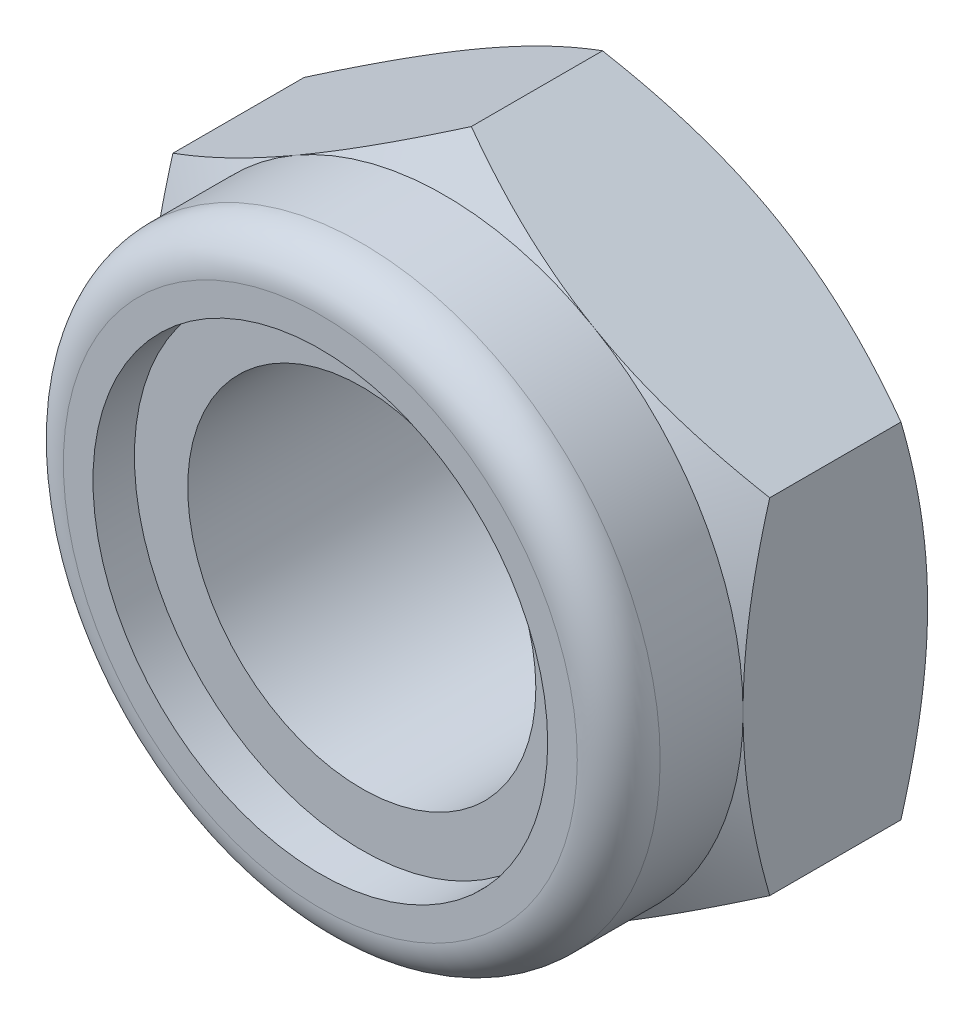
ISO-10303-21;
HEADER;
FILE_DESCRIPTION(('STEP AP214'),'2;1');
FILE_NAME('part.step','',(''),(''),'','','');
FILE_SCHEMA(('AUTOMOTIVE_DESIGN { 1 0 10303 214 1 1 1 1 }'));
ENDSEC;
DATA;
#1=APPLICATION_CONTEXT('core data for automotive mechanical design processes');
#2=APPLICATION_PROTOCOL_DEFINITION('international standard','automotive_design',2000,#1);
#3=PRODUCT_CONTEXT('',#1,'mechanical');
#4=PRODUCT('Part','Part','',(#3));
#5=PRODUCT_RELATED_PRODUCT_CATEGORY('part','',(#4));
#6=PRODUCT_DEFINITION_FORMATION('','',#4);
#7=PRODUCT_DEFINITION_CONTEXT('part definition',#1,'design');
#8=PRODUCT_DEFINITION('design','',#6,#7);
#9=PRODUCT_DEFINITION_SHAPE('','',#8);
#10=(LENGTH_UNIT() NAMED_UNIT(*) SI_UNIT(.MILLI.,.METRE.));
#11=(NAMED_UNIT(*) PLANE_ANGLE_UNIT() SI_UNIT($,.RADIAN.));
#12=(NAMED_UNIT(*) SI_UNIT($,.STERADIAN.) SOLID_ANGLE_UNIT());
#13=UNCERTAINTY_MEASURE_WITH_UNIT(LENGTH_MEASURE(1.E-05),#10,'distance_accuracy_value','');
#14=(GEOMETRIC_REPRESENTATION_CONTEXT(3) GLOBAL_UNCERTAINTY_ASSIGNED_CONTEXT((#13)) GLOBAL_UNIT_ASSIGNED_CONTEXT((#10,
#11,#12)) REPRESENTATION_CONTEXT('',''));
#15=CARTESIAN_POINT('',(0.,0.,0.));
#16=DIRECTION('',(0.,0.,1.));
#17=DIRECTION('',(1.,0.,0.));
#18=AXIS2_PLACEMENT_3D('',#15,#16,#17);
#19=CARTESIAN_POINT('',(0.,0.,-7.42));
#20=DIRECTION('',(0.,0.,1.));
#21=DIRECTION('',(1.,0.,0.));
#22=AXIS2_PLACEMENT_3D('',#19,#20,#21);
#23=CYLINDRICAL_SURFACE('',#22,7.);
#24=CARTESIAN_POINT('',(0.,0.,3.33333333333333));
#25=DIRECTION('',(0.,0.,1.));
#26=DIRECTION('',(1.,0.,0.));
#27=AXIS2_PLACEMENT_3D('',#24,#25,#26);
#28=CIRCLE('',#27,7.);
#29=CARTESIAN_POINT('',(7.,0.,3.33333333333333));
#30=VERTEX_POINT('',#29);
#31=EDGE_CURVE('E281',#30,#30,#28,.T.);
#32=CARTESIAN_POINT('',(0.,0.,-6.69439246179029));
#33=DIRECTION('',(0.,0.,-1.));
#34=DIRECTION('',(-1.,0.,0.));
#35=AXIS2_PLACEMENT_3D('',#32,#33,#34);
#36=CIRCLE('',#35,7.);
#37=CARTESIAN_POINT('',(7.,0.,-6.69439246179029));
#38=VERTEX_POINT('',#37);
#39=EDGE_CURVE('E40',#38,#38,#36,.F.);
#40=CARTESIAN_POINT('',(7.,0.,3.33333333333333));
#41=CARTESIAN_POINT('',(7.,0.,3.22887785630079));
#42=CARTESIAN_POINT('',(7.,0.,3.12442237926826));
#43=CARTESIAN_POINT('',(7.,0.,2.91551142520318));
#44=CARTESIAN_POINT('',(7.,0.,2.81105594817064));
#45=CARTESIAN_POINT('',(7.,0.,2.60214499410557));
#46=CARTESIAN_POINT('',(7.,0.,2.49768951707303));
#47=CARTESIAN_POINT('',(7.,0.,2.28877856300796));
#48=CARTESIAN_POINT('',(7.,0.,2.18432308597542));
#49=CARTESIAN_POINT('',(7.,0.,1.97541213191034));
#50=CARTESIAN_POINT('',(7.,0.,1.8709566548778));
#51=CARTESIAN_POINT('',(7.,0.,1.66204570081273));
#52=CARTESIAN_POINT('',(7.,0.,1.55759022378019));
#53=CARTESIAN_POINT('',(7.,0.,1.34867926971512));
#54=CARTESIAN_POINT('',(7.,0.,1.24422379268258));
#55=CARTESIAN_POINT('',(7.,0.,1.0353128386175));
#56=CARTESIAN_POINT('',(7.,0.,0.930857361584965));
#57=CARTESIAN_POINT('',(7.,0.,0.721946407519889));
#58=CARTESIAN_POINT('',(7.,0.,0.617490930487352));
#59=CARTESIAN_POINT('',(7.,0.,0.408579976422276));
#60=CARTESIAN_POINT('',(7.,0.,0.304124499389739));
#61=CARTESIAN_POINT('',(7.,0.,0.0952135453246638));
#62=CARTESIAN_POINT('',(7.,0.,-0.00924193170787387));
#63=CARTESIAN_POINT('',(7.,0.,-0.21815288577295));
#64=CARTESIAN_POINT('',(7.,0.,-0.322608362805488));
#65=CARTESIAN_POINT('',(7.,0.,-0.531519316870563));
#66=CARTESIAN_POINT('',(7.,0.,-0.635974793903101));
#67=CARTESIAN_POINT('',(7.,0.,-0.844885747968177));
#68=CARTESIAN_POINT('',(7.,0.,-0.949341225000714));
#69=CARTESIAN_POINT('',(7.,0.,-1.15825217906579));
#70=CARTESIAN_POINT('',(7.,0.,-1.26270765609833));
#71=CARTESIAN_POINT('',(7.,0.,-1.4716186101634));
#72=CARTESIAN_POINT('',(7.,0.,-1.57607408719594));
#73=CARTESIAN_POINT('',(7.,0.,-1.78498504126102));
#74=CARTESIAN_POINT('',(7.,0.,-1.88944051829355));
#75=CARTESIAN_POINT('',(7.,0.,-2.09835147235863));
#76=CARTESIAN_POINT('',(7.,0.,-2.20280694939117));
#77=CARTESIAN_POINT('',(7.,0.,-2.41171790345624));
#78=CARTESIAN_POINT('',(7.,0.,-2.51617338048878));
#79=CARTESIAN_POINT('',(7.,0.,-2.72508433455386));
#80=CARTESIAN_POINT('',(7.,0.,-2.82953981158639));
#81=CARTESIAN_POINT('',(7.,0.,-3.03845076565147));
#82=CARTESIAN_POINT('',(7.,0.,-3.14290624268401));
#83=CARTESIAN_POINT('',(7.,0.,-3.35181719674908));
#84=CARTESIAN_POINT('',(7.,0.,-3.45627267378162));
#85=CARTESIAN_POINT('',(7.,0.,-3.66518362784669));
#86=CARTESIAN_POINT('',(7.,0.,-3.76963910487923));
#87=CARTESIAN_POINT('',(7.,0.,-3.97855005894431));
#88=CARTESIAN_POINT('',(7.,0.,-4.08300553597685));
#89=CARTESIAN_POINT('',(7.,0.,-4.29191649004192));
#90=CARTESIAN_POINT('',(7.,0.,-4.39637196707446));
#91=CARTESIAN_POINT('',(7.,0.,-4.60528292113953));
#92=CARTESIAN_POINT('',(7.,0.,-4.70973839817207));
#93=CARTESIAN_POINT('',(7.,0.,-4.91864935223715));
#94=CARTESIAN_POINT('',(7.,0.,-5.02310482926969));
#95=CARTESIAN_POINT('',(7.,0.,-5.23201578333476));
#96=CARTESIAN_POINT('',(7.,0.,-5.3364712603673));
#97=CARTESIAN_POINT('',(7.,0.,-5.54538221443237));
#98=CARTESIAN_POINT('',(7.,0.,-5.64983769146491));
#99=CARTESIAN_POINT('',(7.,0.,-5.85874864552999));
#100=CARTESIAN_POINT('',(7.,0.,-5.96320412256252));
#101=CARTESIAN_POINT('',(7.,0.,-6.1721150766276));
#102=CARTESIAN_POINT('',(7.,0.,-6.27657055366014));
#103=CARTESIAN_POINT('',(7.,0.,-6.48548150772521));
#104=CARTESIAN_POINT('',(7.,0.,-6.58993698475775));
#105=CARTESIAN_POINT('',(7.,0.,-6.69439246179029));
#106=B_SPLINE_CURVE_WITH_KNOTS('',3,(#40,#41,#42,#43,#44,#45,#46,#47,#48,#49,#50,#51,#52,#53,
#54,#55,#56,#57,#58,#59,#60,#61,#62,#63,#64,#65,#66,#67,#68,#69,#70,#71,#72,#73,#74,#75,#76,#77,
#78,#79,#80,#81,#82,#83,#84,#85,#86,#87,#88,#89,#90,#91,#92,#93,#94,#95,#96,#97,#98,#99,#100,
#101,#102,#103,#104,#105),.UNSPECIFIED.,.F.,.F.,(4,2,2,2,2,2,2,2,2,2,2,2,2,2,2,2,2,2,2,2,2,2,2,
2,2,2,2,2,2,2,2,2,4),(0.,0.313366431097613,0.626732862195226,0.940099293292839,1.25346572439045,
1.56683215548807,1.88019858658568,2.19356501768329,2.50693144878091,2.82029787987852,
3.13366431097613,3.44703074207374,3.76039717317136,4.07376360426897,4.38713003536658,
4.7004964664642,5.01386289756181,5.32722932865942,5.64059575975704,5.95396219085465,
6.26732862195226,6.58069505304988,6.89406148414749,7.2074279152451,7.52079434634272,
7.83416077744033,8.14752720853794,8.46089363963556,8.77426007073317,9.08762650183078,
9.40099293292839,9.71435936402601,10.0277257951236),.UNSPECIFIED.);
#107=EDGE_CURVE('BSEAM35',#30,#38,#106,.T.);
#108=ORIENTED_EDGE('',*,*,#31,.T.);
#109=ORIENTED_EDGE('',*,*,#39,.F.);
#110=ORIENTED_EDGE('',*,*,#107,.T.);
#111=ORIENTED_EDGE('',*,*,#107,.F.);
#112=EDGE_LOOP('',(#108,#110,#109,#111));
#113=FACE_BOUND('',#112,.T.);
#114=ADVANCED_FACE('F35',(#113),#23,.F.);
#115=CARTESIAN_POINT('',(0.,13.856406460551,-7.42));
#116=DIRECTION('',(-0.500000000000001,0.866025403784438,0.));
#117=DIRECTION('',(-0.866025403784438,-0.500000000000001,0.));
#118=AXIS2_PLACEMENT_3D('',#115,#116,#117);
#119=PLANE('',#118);
#120=DIRECTION('',(0.,0.,1.));
#121=VECTOR('',#120,1.);
#122=CARTESIAN_POINT('',(-12.,6.9282032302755,-7.42));
#123=LINE('',#122,#121);
#124=CARTESIAN_POINT('',(-12.,6.92820323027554,-6.3482032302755));
#125=VERTEX_POINT('',#124);
#126=CARTESIAN_POINT('',(-12.,6.9282032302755,-1.07179676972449));
#127=VERTEX_POINT('',#126);
#128=EDGE_CURVE('E254',#125,#127,#123,.T.);
#129=ORIENTED_EDGE('',*,*,#128,.T.);
#130=CARTESIAN_POINT('',(-12.0002,6.92808776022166,-1.07186343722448));
#131=CARTESIAN_POINT('',(-11.7364142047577,7.08038456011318,-0.983949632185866));
#132=CARTESIAN_POINT('',(-11.4716448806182,7.2332492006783,-0.900025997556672));
#133=CARTESIAN_POINT('',(-10.9399829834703,7.54020434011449,-0.741266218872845));
#134=CARTESIAN_POINT('',(-10.6730897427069,7.69429522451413,-0.666433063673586));
#135=CARTESIAN_POINT('',(-9.86810959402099,8.15905073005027,-0.457017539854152));
#136=CARTESIAN_POINT('',(-9.3268449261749,8.47155003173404,-0.337903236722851));
#137=CARTESIAN_POINT('',(-8.516867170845,8.93919090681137,-0.198231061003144));
#138=CARTESIAN_POINT('',(-8.25057389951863,9.09293539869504,-0.158443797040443));
#139=CARTESIAN_POINT('',(-7.71675440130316,9.40113622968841,-0.0917233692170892));
#140=CARTESIAN_POINT('',(-7.44922815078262,9.55559258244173,-0.064790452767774));
#141=CARTESIAN_POINT('',(-6.91372963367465,9.86476279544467,-0.0244685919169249));
#142=CARTESIAN_POINT('',(-6.64575827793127,10.0194761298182,-0.0110635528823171));
#143=CARTESIAN_POINT('',(-6.10956726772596,10.3290461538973,0.00191690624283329));
#144=CARTESIAN_POINT('',(-5.84134762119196,10.4839028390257,0.00149275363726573));
#145=CARTESIAN_POINT('',(-5.33991062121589,10.7734076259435,-0.0122200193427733));
#146=CARTESIAN_POINT('',(-5.10665750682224,10.908076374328,-0.0238359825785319));
#147=CARTESIAN_POINT('',(-4.64068775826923,11.1771041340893,-0.0573080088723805));
#148=CARTESIAN_POINT('',(-4.40797116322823,11.3114631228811,-0.0791647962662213));
#149=CARTESIAN_POINT('',(-3.94320092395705,11.5797983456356,-0.132737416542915));
#150=CARTESIAN_POINT('',(-3.71114798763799,11.7137741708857,-0.16446139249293));
#151=CARTESIAN_POINT('',(-3.24813003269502,11.9810977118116,-0.237211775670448));
#152=CARTESIAN_POINT('',(-3.01716508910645,12.1144453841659,-0.278238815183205));
#153=CARTESIAN_POINT('',(-2.31605804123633,12.5192297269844,-0.416311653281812));
#154=CARTESIAN_POINT('',(-1.84794625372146,12.789494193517,-0.527124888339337));
#155=CARTESIAN_POINT('',(-0.918702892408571,13.3259930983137,-0.778625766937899));
#156=CARTESIAN_POINT('',(-0.457559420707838,13.5922344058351,-0.919254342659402));
#157=CARTESIAN_POINT('',(0.000200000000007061,13.8565219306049,-1.0718634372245));
#158=B_SPLINE_CURVE_WITH_KNOTS('',3,(#130,#131,#132,#133,#134,#135,#136,#137,#138,#139,#140,
#141,#142,#143,#144,#145,#146,#147,#148,#149,#150,#151,#152,#153,#154,#155,#156,#157),
.UNSPECIFIED.,.F.,.F.,(4,2,2,2,2,2,2,2,2,2,2,2,2,4),(0.,0.951004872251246,1.90232158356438,
3.80900466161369,4.73894551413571,5.6689042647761,6.59775529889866,7.52657763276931,
8.3351464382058,9.1437724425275,9.95306755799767,10.7624176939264,12.4167102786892,
14.0677556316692),.UNSPECIFIED.);
#159=CARTESIAN_POINT('',(-6.00000000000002,10.3923048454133,0.));
#160=VERTEX_POINT('',#159);
#161=EDGE_CURVE('E60',#127,#160,#158,.T.);
#162=ORIENTED_EDGE('',*,*,#161,.T.);
#163=CARTESIAN_POINT('',(0.,13.856406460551,-1.0717967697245));
#164=VERTEX_POINT('',#163);
#165=EDGE_CURVE('E203',#160,#164,#158,.T.);
#166=ORIENTED_EDGE('',*,*,#165,.T.);
#167=DIRECTION('',(0.,0.,1.));
#168=VECTOR('',#167,1.);
#169=CARTESIAN_POINT('',(0.,13.856406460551,-7.42));
#170=LINE('',#169,#168);
#171=CARTESIAN_POINT('',(0.,13.856406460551,-6.3482032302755));
#172=VERTEX_POINT('',#171);
#173=EDGE_CURVE('E240',#172,#164,#170,.T.);
#174=ORIENTED_EDGE('',*,*,#173,.F.);
#175=CARTESIAN_POINT('',(-12.0002,6.92808776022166,-6.34813656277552));
#176=CARTESIAN_POINT('',(-11.7364142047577,7.08038456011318,-6.43605036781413));
#177=CARTESIAN_POINT('',(-11.4716448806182,7.2332492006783,-6.51997400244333));
#178=CARTESIAN_POINT('',(-10.9399829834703,7.54020434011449,-6.67873378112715));
#179=CARTESIAN_POINT('',(-10.6730897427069,7.69429522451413,-6.75356693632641));
#180=CARTESIAN_POINT('',(-9.86810959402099,8.15905073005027,-6.96298246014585));
#181=CARTESIAN_POINT('',(-9.3268449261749,8.47155003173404,-7.08209676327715));
#182=CARTESIAN_POINT('',(-8.516867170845,8.93919090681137,-7.22176893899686));
#183=CARTESIAN_POINT('',(-8.25057389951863,9.09293539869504,-7.26155620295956));
#184=CARTESIAN_POINT('',(-7.71675440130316,9.40113622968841,-7.32827663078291));
#185=CARTESIAN_POINT('',(-7.44922815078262,9.55559258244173,-7.35520954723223));
#186=CARTESIAN_POINT('',(-6.91372963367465,9.86476279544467,-7.39553140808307));
#187=CARTESIAN_POINT('',(-6.64575827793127,10.0194761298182,-7.40893644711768));
#188=CARTESIAN_POINT('',(-6.10956726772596,10.3290461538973,-7.42191690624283));
#189=CARTESIAN_POINT('',(-5.84134762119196,10.4839028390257,-7.42149275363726));
#190=CARTESIAN_POINT('',(-5.33991062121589,10.7734076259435,-7.40777998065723));
#191=CARTESIAN_POINT('',(-5.10665750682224,10.908076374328,-7.39616401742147));
#192=CARTESIAN_POINT('',(-4.64068775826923,11.1771041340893,-7.36269199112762));
#193=CARTESIAN_POINT('',(-4.40797116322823,11.3114631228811,-7.34083520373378));
#194=CARTESIAN_POINT('',(-3.94320092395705,11.5797983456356,-7.28726258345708));
#195=CARTESIAN_POINT('',(-3.71114798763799,11.7137741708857,-7.25553860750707));
#196=CARTESIAN_POINT('',(-3.24813003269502,11.9810977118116,-7.18278822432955));
#197=CARTESIAN_POINT('',(-3.01716508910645,12.1144453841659,-7.14176118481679));
#198=CARTESIAN_POINT('',(-2.31605804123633,12.5192297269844,-7.00368834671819));
#199=CARTESIAN_POINT('',(-1.84794625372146,12.789494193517,-6.89287511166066));
#200=CARTESIAN_POINT('',(-0.918702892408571,13.3259930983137,-6.6413742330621));
#201=CARTESIAN_POINT('',(-0.457559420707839,13.5922344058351,-6.5007456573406));
#202=CARTESIAN_POINT('',(0.000200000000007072,13.8565219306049,-6.3481365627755));
#203=B_SPLINE_CURVE_WITH_KNOTS('',3,(#175,#176,#177,#178,#179,#180,#181,#182,#183,#184,#185,
#186,#187,#188,#189,#190,#191,#192,#193,#194,#195,#196,#197,#198,#199,#200,#201,#202),
.UNSPECIFIED.,.F.,.F.,(4,2,2,2,2,2,2,2,2,2,2,2,2,4),(0.,0.951004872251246,1.90232158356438,
3.80900466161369,4.73894551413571,5.6689042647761,6.59775529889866,7.52657763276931,
8.3351464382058,9.1437724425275,9.95306755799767,10.7624176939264,12.4167102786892,
14.0677556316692),.UNSPECIFIED.);
#204=CARTESIAN_POINT('',(-6.00000000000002,10.3923048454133,-7.42));
#205=VERTEX_POINT('',#204);
#206=EDGE_CURVE('E256',#205,#172,#203,.T.);
#207=ORIENTED_EDGE('',*,*,#206,.F.);
#208=EDGE_CURVE('E234',#125,#205,#203,.T.);
#209=ORIENTED_EDGE('',*,*,#208,.F.);
#210=EDGE_LOOP('',(#129,#162,#166,#174,#207,#209));
#211=FACE_BOUND('',#210,.T.);
#212=ADVANCED_FACE('F37',(#211),#119,.T.);
#213=CARTESIAN_POINT('',(12.,6.92820323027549,-7.42));
#214=DIRECTION('',(0.500000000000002,0.866025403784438,0.));
#215=DIRECTION('',(-0.866025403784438,0.500000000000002,0.));
#216=AXIS2_PLACEMENT_3D('',#213,#214,#215);
#217=PLANE('',#216);
#218=ORIENTED_EDGE('',*,*,#173,.T.);
#219=CARTESIAN_POINT('',(-0.000199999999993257,13.8565219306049,-1.07186343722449));
#220=CARTESIAN_POINT('',(0.263585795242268,13.7042251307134,-0.983949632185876));
#221=CARTESIAN_POINT('',(0.528355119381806,13.5513604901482,-0.90002599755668));
#222=CARTESIAN_POINT('',(1.06001701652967,13.244405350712,-0.741266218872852));
#223=CARTESIAN_POINT('',(1.32691025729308,13.0903144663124,-0.666433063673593));
#224=CARTESIAN_POINT('',(2.13189040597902,12.6255589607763,-0.45701753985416));
#225=CARTESIAN_POINT('',(2.67315507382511,12.3130596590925,-0.337903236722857));
#226=CARTESIAN_POINT('',(3.48313282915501,11.8454187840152,-0.198231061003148));
#227=CARTESIAN_POINT('',(3.74942610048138,11.6916742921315,-0.158443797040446));
#228=CARTESIAN_POINT('',(4.28324559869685,11.3834734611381,-0.0917233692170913));
#229=CARTESIAN_POINT('',(4.55077184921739,11.2290171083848,-0.0647904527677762));
#230=CARTESIAN_POINT('',(5.08627036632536,10.9198468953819,-0.0244685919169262));
#231=CARTESIAN_POINT('',(5.35424172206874,10.7651335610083,-0.0110635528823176));
#232=CARTESIAN_POINT('',(5.89043273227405,10.4555635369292,0.0019169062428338));
#233=CARTESIAN_POINT('',(6.15865237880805,10.3007068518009,0.0014927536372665));
#234=CARTESIAN_POINT('',(6.66008937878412,10.011202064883,-0.0122200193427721));
#235=CARTESIAN_POINT('',(6.89334249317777,9.87653331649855,-0.0238359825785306));
#236=CARTESIAN_POINT('',(7.35931224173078,9.60750555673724,-0.0573080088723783));
#237=CARTESIAN_POINT('',(7.59202883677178,9.47314656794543,-0.0791647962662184));
#238=CARTESIAN_POINT('',(8.05679907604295,9.20481134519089,-0.13273741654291));
#239=CARTESIAN_POINT('',(8.28885201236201,9.07083551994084,-0.164461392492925));
#240=CARTESIAN_POINT('',(8.75186996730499,8.80351197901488,-0.237211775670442));
#241=CARTESIAN_POINT('',(8.98283491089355,8.67016430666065,-0.278238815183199));
#242=CARTESIAN_POINT('',(9.68394195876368,8.26537996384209,-0.416311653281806));
#243=CARTESIAN_POINT('',(10.1520537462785,7.99511549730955,-0.527124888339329));
#244=CARTESIAN_POINT('',(11.0812971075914,7.45861659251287,-0.778625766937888));
#245=CARTESIAN_POINT('',(11.5424405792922,7.19237528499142,-0.919254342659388));
#246=CARTESIAN_POINT('',(12.0002,6.92808776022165,-1.07186343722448));
#247=B_SPLINE_CURVE_WITH_KNOTS('',3,(#219,#220,#221,#222,#223,#224,#225,#226,#227,#228,#229,
#230,#231,#232,#233,#234,#235,#236,#237,#238,#239,#240,#241,#242,#243,#244,#245,#246),
.UNSPECIFIED.,.F.,.F.,(4,2,2,2,2,2,2,2,2,2,2,2,2,4),(0.,0.951004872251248,1.90232158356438,
3.8090046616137,4.73894551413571,5.66890426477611,6.59775529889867,7.52657763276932,
8.3351464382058,9.14377244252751,9.95306755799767,10.7624176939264,12.4167102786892,
14.0677556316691),.UNSPECIFIED.);
#248=CARTESIAN_POINT('',(6.00000000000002,10.3923048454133,0.));
#249=VERTEX_POINT('',#248);
#250=EDGE_CURVE('E212',#164,#249,#247,.T.);
#251=ORIENTED_EDGE('',*,*,#250,.T.);
#252=CARTESIAN_POINT('',(12.,6.92820323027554,-1.0717967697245));
#253=VERTEX_POINT('',#252);
#254=EDGE_CURVE('E204',#249,#253,#247,.T.);
#255=ORIENTED_EDGE('',*,*,#254,.T.);
#256=DIRECTION('',(0.,0.,1.));
#257=VECTOR('',#256,1.);
#258=CARTESIAN_POINT('',(12.,6.92820323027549,-7.42));
#259=LINE('',#258,#257);
#260=CARTESIAN_POINT('',(12.,6.92820323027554,-6.3482032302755));
#261=VERTEX_POINT('',#260);
#262=EDGE_CURVE('E244',#261,#253,#259,.T.);
#263=ORIENTED_EDGE('',*,*,#262,.F.);
#264=CARTESIAN_POINT('',(-0.000199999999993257,13.8565219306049,-6.3481365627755));
#265=CARTESIAN_POINT('',(0.263585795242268,13.7042251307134,-6.43605036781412));
#266=CARTESIAN_POINT('',(0.528355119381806,13.5513604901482,-6.51997400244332));
#267=CARTESIAN_POINT('',(1.06001701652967,13.244405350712,-6.67873378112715));
#268=CARTESIAN_POINT('',(1.32691025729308,13.0903144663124,-6.75356693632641));
#269=CARTESIAN_POINT('',(2.13189040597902,12.6255589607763,-6.96298246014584));
#270=CARTESIAN_POINT('',(2.67315507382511,12.3130596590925,-7.08209676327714));
#271=CARTESIAN_POINT('',(3.48313282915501,11.8454187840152,-7.22176893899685));
#272=CARTESIAN_POINT('',(3.74942610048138,11.6916742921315,-7.26155620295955));
#273=CARTESIAN_POINT('',(4.28324559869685,11.3834734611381,-7.32827663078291));
#274=CARTESIAN_POINT('',(4.55077184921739,11.2290171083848,-7.35520954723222));
#275=CARTESIAN_POINT('',(5.08627036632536,10.9198468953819,-7.39553140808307));
#276=CARTESIAN_POINT('',(5.35424172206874,10.7651335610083,-7.40893644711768));
#277=CARTESIAN_POINT('',(5.89043273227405,10.4555635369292,-7.42191690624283));
#278=CARTESIAN_POINT('',(6.15865237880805,10.3007068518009,-7.42149275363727));
#279=CARTESIAN_POINT('',(6.66008937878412,10.011202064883,-7.40777998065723));
#280=CARTESIAN_POINT('',(6.89334249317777,9.87653331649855,-7.39616401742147));
#281=CARTESIAN_POINT('',(7.35931224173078,9.60750555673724,-7.36269199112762));
#282=CARTESIAN_POINT('',(7.59202883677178,9.47314656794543,-7.34083520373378));
#283=CARTESIAN_POINT('',(8.05679907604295,9.20481134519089,-7.28726258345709));
#284=CARTESIAN_POINT('',(8.28885201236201,9.07083551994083,-7.25553860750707));
#285=CARTESIAN_POINT('',(8.75186996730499,8.80351197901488,-7.18278822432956));
#286=CARTESIAN_POINT('',(8.98283491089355,8.67016430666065,-7.1417611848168));
#287=CARTESIAN_POINT('',(9.68394195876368,8.26537996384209,-7.00368834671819));
#288=CARTESIAN_POINT('',(10.1520537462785,7.99511549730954,-6.89287511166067));
#289=CARTESIAN_POINT('',(11.0812971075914,7.45861659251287,-6.64137423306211));
#290=CARTESIAN_POINT('',(11.5424405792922,7.19237528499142,-6.50074565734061));
#291=CARTESIAN_POINT('',(12.0002,6.92808776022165,-6.34813656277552));
#292=B_SPLINE_CURVE_WITH_KNOTS('',3,(#264,#265,#266,#267,#268,#269,#270,#271,#272,#273,#274,
#275,#276,#277,#278,#279,#280,#281,#282,#283,#284,#285,#286,#287,#288,#289,#290,#291),
.UNSPECIFIED.,.F.,.F.,(4,2,2,2,2,2,2,2,2,2,2,2,2,4),(0.,0.951004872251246,1.90232158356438,
3.8090046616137,4.73894551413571,5.66890426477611,6.59775529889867,7.52657763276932,
8.3351464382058,9.14377244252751,9.95306755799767,10.7624176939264,12.4167102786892,
14.0677556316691),.UNSPECIFIED.);
#293=CARTESIAN_POINT('',(6.00000000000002,10.3923048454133,-7.42));
#294=VERTEX_POINT('',#293);
#295=EDGE_CURVE('E225',#294,#261,#292,.T.);
#296=ORIENTED_EDGE('',*,*,#295,.F.);
#297=EDGE_CURVE('E232',#172,#294,#292,.T.);
#298=ORIENTED_EDGE('',*,*,#297,.F.);
#299=EDGE_LOOP('',(#218,#251,#255,#263,#296,#298));
#300=FACE_BOUND('',#299,.T.);
#301=ADVANCED_FACE('F215',(#300),#217,.T.);
#302=CARTESIAN_POINT('',(12.,6.92820323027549,-7.42));
#303=DIRECTION('',(-1.,0.,0.));
#304=DIRECTION('',(0.,0.,1.));
#305=AXIS2_PLACEMENT_3D('',#302,#303,#304);
#306=PLANE('',#305);
#307=CARTESIAN_POINT('',(12.,-18.3746159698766,-5.74232046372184));
#308=CARTESIAN_POINT('',(12.,-18.1111918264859,-5.61498513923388));
#309=CARTESIAN_POINT('',(12.,-17.8474492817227,-5.48830883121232));
#310=CARTESIAN_POINT('',(12.,-17.3192601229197,-5.23642551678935));
#311=CARTESIAN_POINT('',(12.,-17.0548135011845,-5.11121852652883));
#312=CARTESIAN_POINT('',(12.,-16.2602391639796,-4.73799215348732));
#313=CARTESIAN_POINT('',(12.,-15.7289626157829,-4.49240888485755));
#314=CARTESIAN_POINT('',(12.,-14.659698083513,-4.00791887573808));
#315=CARTESIAN_POINT('',(12.,-14.1216890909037,-3.7690583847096));
#316=CARTESIAN_POINT('',(12.,-13.0412497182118,-3.30159295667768));
#317=CARTESIAN_POINT('',(12.,-12.4988195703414,-3.07298748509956));
#318=CARTESIAN_POINT('',(12.,-11.4019415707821,-2.62605165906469));
#319=CARTESIAN_POINT('',(12.,-10.8474279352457,-2.40788190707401));
#320=CARTESIAN_POINT('',(12.,-9.73185625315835,-1.98862863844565));
#321=CARTESIAN_POINT('',(12.,-9.17079748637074,-1.78754702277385));
#322=CARTESIAN_POINT('',(12.,-8.04241377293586,-1.40787575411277));
#323=CARTESIAN_POINT('',(12.,-7.4751050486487,-1.22923828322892));
#324=CARTESIAN_POINT('',(12.,-6.33236790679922,-0.900248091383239));
#325=CARTESIAN_POINT('',(12.,-5.75694211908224,-0.74988642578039));
#326=CARTESIAN_POINT('',(12.,-4.88760620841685,-0.55105505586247));
#327=CARTESIAN_POINT('',(12.,-4.59673300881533,-0.489219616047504));
#328=CARTESIAN_POINT('',(12.,-4.01305048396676,-0.375428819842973));
#329=CARTESIAN_POINT('',(12.,-3.72024120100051,-0.32347324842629));
#330=CARTESIAN_POINT('',(12.,-3.13287727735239,-0.230362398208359));
#331=CARTESIAN_POINT('',(12.,-2.83832249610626,-0.189208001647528));
#332=CARTESIAN_POINT('',(12.,-2.24782315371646,-0.118528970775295));
#333=CARTESIAN_POINT('',(12.,-1.9518786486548,-0.0890038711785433));
#334=CARTESIAN_POINT('',(12.,-1.36089234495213,-0.0423753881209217));
#335=CARTESIAN_POINT('',(12.,-1.06585670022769,-0.025194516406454));
#336=CARTESIAN_POINT('',(12.,-0.475323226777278,-0.00334573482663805));
#337=CARTESIAN_POINT('',(12.,-0.1798254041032,0.00132233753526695));
#338=CARTESIAN_POINT('',(12.,0.411018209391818,-0.00196522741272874));
#339=CARTESIAN_POINT('',(12.,0.706364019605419,-0.00991732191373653));
#340=CARTESIAN_POINT('',(12.,1.29646300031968,-0.0382476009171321));
#341=CARTESIAN_POINT('',(12.,1.59121614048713,-0.0586264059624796));
#342=CARTESIAN_POINT('',(12.,2.30560702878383,-0.122652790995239));
#343=CARTESIAN_POINT('',(12.,2.72469590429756,-0.172526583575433));
#344=CARTESIAN_POINT('',(12.,3.55966217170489,-0.294627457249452));
#345=CARTESIAN_POINT('',(12.,3.97553865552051,-0.366860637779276));
#346=CARTESIAN_POINT('',(12.,4.80373712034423,-0.531118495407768));
#347=CARTESIAN_POINT('',(12.,5.21605535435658,-0.623161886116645));
#348=CARTESIAN_POINT('',(12.,6.03644960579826,-0.824231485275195));
#349=CARTESIAN_POINT('',(12.,6.44452601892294,-0.933256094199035));
#350=CARTESIAN_POINT('',(12.,7.26648771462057,-1.16853096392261));
#351=CARTESIAN_POINT('',(12.,7.68027019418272,-1.29513795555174));
#352=CARTESIAN_POINT('',(12.,8.5034606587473,-1.5608576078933));
#353=CARTESIAN_POINT('',(12.,8.91287144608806,-1.69996164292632));
#354=CARTESIAN_POINT('',(12.,9.72567950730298,-1.98781971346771));
#355=CARTESIAN_POINT('',(12.,10.1290976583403,-2.1365150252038));
#356=CARTESIAN_POINT('',(12.,10.7318330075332,-2.36605061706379));
#357=CARTESIAN_POINT('',(12.,10.9323890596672,-2.44366199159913));
#358=CARTESIAN_POINT('',(12.,11.3327210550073,-2.60085858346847));
#359=CARTESIAN_POINT('',(12.,11.5324970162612,-2.68044375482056));
#360=CARTESIAN_POINT('',(12.,11.7319109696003,-2.76092701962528));
#361=B_SPLINE_CURVE_WITH_KNOTS('',3,(#307,#308,#309,#310,#311,#312,#313,#314,#315,#316,#317,
#318,#319,#320,#321,#322,#323,#324,#325,#326,#327,#328,#329,#330,#331,#332,#333,#334,#335,#336,
#337,#338,#339,#340,#341,#342,#343,#344,#345,#346,#347,#348,#349,#350,#351,#352,#353,#354,#355,
#356,#357,#358,#359,#360),.UNSPECIFIED.,.F.,.F.,(4,2,2,2,2,2,2,2,2,2,2,2,2,2,2,2,2,2,2,2,2,2,2,
2,2,2,4),(0.,0.877756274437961,1.75552218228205,3.51133949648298,5.27720464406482,
7.04297763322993,8.83042883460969,10.6180786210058,12.4018527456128,14.1850616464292,
15.0770405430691,15.9690000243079,16.861032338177,17.7530289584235,18.63937614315,
19.5257118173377,20.4117987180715,21.2979298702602,22.5633628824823,23.8291413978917,
25.0961209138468,26.3629811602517,27.6608948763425,28.9579195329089,30.2476436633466,
30.8927835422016,31.5379084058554),.UNSPECIFIED.);
#362=CARTESIAN_POINT('',(12.,-6.92820323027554,-1.0717967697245));
#363=VERTEX_POINT('',#362);
#364=CARTESIAN_POINT('',(12.,0.,0.));
#365=VERTEX_POINT('',#364);
#366=EDGE_CURVE('E191',#363,#365,#361,.T.);
#367=ORIENTED_EDGE('',*,*,#366,.F.);
#368=DIRECTION('',(0.,0.,1.));
#369=VECTOR('',#368,1.);
#370=CARTESIAN_POINT('',(12.,-6.92820323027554,-7.42));
#371=LINE('',#370,#369);
#372=CARTESIAN_POINT('',(12.,-6.92820323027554,-6.3482032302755));
#373=VERTEX_POINT('',#372);
#374=EDGE_CURVE('E247',#373,#363,#371,.T.);
#375=ORIENTED_EDGE('',*,*,#374,.F.);
#376=CARTESIAN_POINT('',(12.,-18.3746159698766,-1.67767953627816));
#377=CARTESIAN_POINT('',(12.,-18.1111918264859,-1.80501486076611));
#378=CARTESIAN_POINT('',(12.,-17.8474492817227,-1.93169116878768));
#379=CARTESIAN_POINT('',(12.,-17.3192601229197,-2.18357448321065));
#380=CARTESIAN_POINT('',(12.,-17.0548135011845,-2.30878147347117));
#381=CARTESIAN_POINT('',(12.,-16.2602391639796,-2.68200784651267));
#382=CARTESIAN_POINT('',(12.,-15.7289626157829,-2.92759111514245));
#383=CARTESIAN_POINT('',(12.,-14.659698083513,-3.41208112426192));
#384=CARTESIAN_POINT('',(12.,-14.1216890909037,-3.6509416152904));
#385=CARTESIAN_POINT('',(12.,-13.0412497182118,-4.11840704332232));
#386=CARTESIAN_POINT('',(12.,-12.4988195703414,-4.34701251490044));
#387=CARTESIAN_POINT('',(12.,-11.4019415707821,-4.79394834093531));
#388=CARTESIAN_POINT('',(12.,-10.8474279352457,-5.01211809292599));
#389=CARTESIAN_POINT('',(12.,-9.73185625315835,-5.43137136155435));
#390=CARTESIAN_POINT('',(12.,-9.17079748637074,-5.63245297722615));
#391=CARTESIAN_POINT('',(12.,-8.04241377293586,-6.01212424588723));
#392=CARTESIAN_POINT('',(12.,-7.4751050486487,-6.19076171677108));
#393=CARTESIAN_POINT('',(12.,-6.33236790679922,-6.51975190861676));
#394=CARTESIAN_POINT('',(12.,-5.75694211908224,-6.67011357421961));
#395=CARTESIAN_POINT('',(12.,-4.88760620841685,-6.86894494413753));
#396=CARTESIAN_POINT('',(12.,-4.59673300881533,-6.9307803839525));
#397=CARTESIAN_POINT('',(12.,-4.01305048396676,-7.04457118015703));
#398=CARTESIAN_POINT('',(12.,-3.72024120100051,-7.09652675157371));
#399=CARTESIAN_POINT('',(12.,-3.13287727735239,-7.18963760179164));
#400=CARTESIAN_POINT('',(12.,-2.83832249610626,-7.23079199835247));
#401=CARTESIAN_POINT('',(12.,-2.24782315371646,-7.3014710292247));
#402=CARTESIAN_POINT('',(12.,-1.9518786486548,-7.33099612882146));
#403=CARTESIAN_POINT('',(12.,-1.36089234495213,-7.37762461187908));
#404=CARTESIAN_POINT('',(12.,-1.06585670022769,-7.39480548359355));
#405=CARTESIAN_POINT('',(12.,-0.475323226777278,-7.41665426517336));
#406=CARTESIAN_POINT('',(12.,-0.1798254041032,-7.42132233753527));
#407=CARTESIAN_POINT('',(12.,0.411018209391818,-7.41803477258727));
#408=CARTESIAN_POINT('',(12.,0.706364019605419,-7.41008267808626));
#409=CARTESIAN_POINT('',(12.,1.29646300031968,-7.38175239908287));
#410=CARTESIAN_POINT('',(12.,1.59121614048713,-7.36137359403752));
#411=CARTESIAN_POINT('',(12.,2.30560702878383,-7.29734720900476));
#412=CARTESIAN_POINT('',(12.,2.72469590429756,-7.24747341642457));
#413=CARTESIAN_POINT('',(12.,3.55966217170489,-7.12537254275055));
#414=CARTESIAN_POINT('',(12.,3.97553865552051,-7.05313936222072));
#415=CARTESIAN_POINT('',(12.,4.80373712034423,-6.88888150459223));
#416=CARTESIAN_POINT('',(12.,5.21605535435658,-6.79683811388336));
#417=CARTESIAN_POINT('',(12.,6.03644960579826,-6.59576851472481));
#418=CARTESIAN_POINT('',(12.,6.44452601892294,-6.48674390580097));
#419=CARTESIAN_POINT('',(12.,7.26648771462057,-6.25146903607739));
#420=CARTESIAN_POINT('',(12.,7.68027019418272,-6.12486204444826));
#421=CARTESIAN_POINT('',(12.,8.5034606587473,-5.8591423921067));
#422=CARTESIAN_POINT('',(12.,8.91287144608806,-5.72003835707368));
#423=CARTESIAN_POINT('',(12.,9.72567950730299,-5.43218028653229));
#424=CARTESIAN_POINT('',(12.,10.1290976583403,-5.2834849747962));
#425=CARTESIAN_POINT('',(12.,10.7318330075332,-5.05394938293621));
#426=CARTESIAN_POINT('',(12.,10.9323890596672,-4.97633800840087));
#427=CARTESIAN_POINT('',(12.,11.3327210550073,-4.81914141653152));
#428=CARTESIAN_POINT('',(12.,11.5324970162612,-4.73955624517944));
#429=CARTESIAN_POINT('',(12.,11.7319109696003,-4.65907298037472));
#430=B_SPLINE_CURVE_WITH_KNOTS('',3,(#376,#377,#378,#379,#380,#381,#382,#383,#384,#385,#386,
#387,#388,#389,#390,#391,#392,#393,#394,#395,#396,#397,#398,#399,#400,#401,#402,#403,#404,#405,
#406,#407,#408,#409,#410,#411,#412,#413,#414,#415,#416,#417,#418,#419,#420,#421,#422,#423,#424,
#425,#426,#427,#428,#429),.UNSPECIFIED.,.F.,.F.,(4,2,2,2,2,2,2,2,2,2,2,2,2,2,2,2,2,2,2,2,2,2,2,
2,2,2,4),(0.,0.877756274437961,1.75552218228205,3.51133949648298,5.27720464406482,
7.04297763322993,8.83042883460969,10.6180786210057,12.4018527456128,14.1850616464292,
15.0770405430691,15.9690000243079,16.861032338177,17.7530289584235,18.63937614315,
19.5257118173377,20.4117987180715,21.2979298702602,22.5633628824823,23.8291413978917,
25.0961209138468,26.3629811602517,27.6608948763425,28.9579195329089,30.2476436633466,
30.8927835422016,31.5379084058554),.UNSPECIFIED.);
#431=CARTESIAN_POINT('',(12.,0.,-7.42));
#432=VERTEX_POINT('',#431);
#433=EDGE_CURVE('E372',#373,#432,#430,.T.);
#434=ORIENTED_EDGE('',*,*,#433,.T.);
#435=EDGE_CURVE('E233',#432,#261,#430,.T.);
#436=ORIENTED_EDGE('',*,*,#435,.T.);
#437=ORIENTED_EDGE('',*,*,#262,.T.);
#438=EDGE_CURVE('E202',#365,#253,#361,.T.);
#439=ORIENTED_EDGE('',*,*,#438,.F.);
#440=EDGE_LOOP('',(#367,#375,#434,#436,#437,#439));
#441=FACE_BOUND('',#440,.T.);
#442=ADVANCED_FACE('F219',(#441),#306,.F.);
#443=CARTESIAN_POINT('',(0.,-13.8564064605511,-7.42));
#444=DIRECTION('',(0.500000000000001,-0.866025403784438,0.));
#445=DIRECTION('',(0.866025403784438,0.500000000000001,0.));
#446=AXIS2_PLACEMENT_3D('',#443,#444,#445);
#447=PLANE('',#446);
#448=ORIENTED_EDGE('',*,*,#374,.T.);
#449=CARTESIAN_POINT('',(12.0002,-6.9280877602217,-1.0718634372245));
#450=CARTESIAN_POINT('',(11.7364142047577,-7.08038456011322,-0.983949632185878));
#451=CARTESIAN_POINT('',(11.4716448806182,-7.23324920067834,-0.900025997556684));
#452=CARTESIAN_POINT('',(10.9399829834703,-7.54020434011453,-0.741266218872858));
#453=CARTESIAN_POINT('',(10.6730897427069,-7.69429522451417,-0.666433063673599));
#454=CARTESIAN_POINT('',(9.86810959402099,-8.15905073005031,-0.457017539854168));
#455=CARTESIAN_POINT('',(9.3268449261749,-8.47155003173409,-0.337903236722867));
#456=CARTESIAN_POINT('',(8.516867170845,-8.93919090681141,-0.19823106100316));
#457=CARTESIAN_POINT('',(8.25057389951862,-9.09293539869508,-0.15844379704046));
#458=CARTESIAN_POINT('',(7.71675440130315,-9.40113622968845,-0.091723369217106));
#459=CARTESIAN_POINT('',(7.44922815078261,-9.55559258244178,-0.0647904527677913));
#460=CARTESIAN_POINT('',(6.91372963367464,-9.86476279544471,-0.0244685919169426));
#461=CARTESIAN_POINT('',(6.64575827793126,-10.0194761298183,-0.0110635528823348));
#462=CARTESIAN_POINT('',(6.10956726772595,-10.3290461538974,0.00191690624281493));
#463=CARTESIAN_POINT('',(5.84134762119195,-10.4839028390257,0.00149275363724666));
#464=CARTESIAN_POINT('',(5.33991062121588,-10.7734076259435,-0.0122200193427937));
#465=CARTESIAN_POINT('',(5.10665750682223,-10.908076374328,-0.0238359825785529));
#466=CARTESIAN_POINT('',(4.64068775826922,-11.1771041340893,-0.0573080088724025));
#467=CARTESIAN_POINT('',(4.40797116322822,-11.3114631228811,-0.0791647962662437));
#468=CARTESIAN_POINT('',(3.94320092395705,-11.5797983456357,-0.132737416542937));
#469=CARTESIAN_POINT('',(3.71114798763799,-11.7137741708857,-0.164461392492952));
#470=CARTESIAN_POINT('',(3.24813003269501,-11.9810977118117,-0.23721177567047));
#471=CARTESIAN_POINT('',(3.01716508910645,-12.1144453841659,-0.278238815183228));
#472=CARTESIAN_POINT('',(2.31605804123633,-12.5192297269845,-0.416311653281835));
#473=CARTESIAN_POINT('',(1.84794625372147,-12.789494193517,-0.52712488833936));
#474=CARTESIAN_POINT('',(0.918702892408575,-13.3259930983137,-0.778625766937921));
#475=CARTESIAN_POINT('',(0.457559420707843,-13.5922344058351,-0.919254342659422));
#476=CARTESIAN_POINT('',(-0.000200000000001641,-13.8565219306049,-1.07186343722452));
#477=B_SPLINE_CURVE_WITH_KNOTS('',3,(#449,#450,#451,#452,#453,#454,#455,#456,#457,#458,#459,
#460,#461,#462,#463,#464,#465,#466,#467,#468,#469,#470,#471,#472,#473,#474,#475,#476),
.UNSPECIFIED.,.F.,.F.,(4,2,2,2,2,2,2,2,2,2,2,2,2,4),(0.,0.95100487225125,1.90232158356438,
3.8090046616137,4.73894551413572,5.66890426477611,6.59775529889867,7.52657763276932,
8.33514643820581,9.14377244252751,9.95306755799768,10.7624176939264,12.4167102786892,
14.0677556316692),.UNSPECIFIED.);
#478=CARTESIAN_POINT('',(6.00000000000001,-10.3923048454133,0.));
#479=VERTEX_POINT('',#478);
#480=EDGE_CURVE('E366',#363,#479,#477,.T.);
#481=ORIENTED_EDGE('',*,*,#480,.T.);
#482=CARTESIAN_POINT('',(0.,-13.856406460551,-1.0717967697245));
#483=VERTEX_POINT('',#482);
#484=EDGE_CURVE('E184',#479,#483,#477,.T.);
#485=ORIENTED_EDGE('',*,*,#484,.T.);
#486=DIRECTION('',(0.,0.,1.));
#487=VECTOR('',#486,1.);
#488=CARTESIAN_POINT('',(0.,-13.8564064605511,-7.42));
#489=LINE('',#488,#487);
#490=CARTESIAN_POINT('',(0.,-13.856406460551,-6.3482032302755));
#491=VERTEX_POINT('',#490);
#492=EDGE_CURVE('E250',#491,#483,#489,.T.);
#493=ORIENTED_EDGE('',*,*,#492,.F.);
#494=CARTESIAN_POINT('',(12.0002,-6.9280877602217,-6.3481365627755));
#495=CARTESIAN_POINT('',(11.7364142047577,-7.08038456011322,-6.43605036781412));
#496=CARTESIAN_POINT('',(11.4716448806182,-7.23324920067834,-6.51997400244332));
#497=CARTESIAN_POINT('',(10.9399829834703,-7.54020434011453,-6.67873378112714));
#498=CARTESIAN_POINT('',(10.6730897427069,-7.69429522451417,-6.7535669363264));
#499=CARTESIAN_POINT('',(9.86810959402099,-8.15905073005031,-6.96298246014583));
#500=CARTESIAN_POINT('',(9.3268449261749,-8.47155003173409,-7.08209676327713));
#501=CARTESIAN_POINT('',(8.516867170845,-8.93919090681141,-7.22176893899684));
#502=CARTESIAN_POINT('',(8.25057389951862,-9.09293539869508,-7.26155620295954));
#503=CARTESIAN_POINT('',(7.71675440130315,-9.40113622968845,-7.32827663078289));
#504=CARTESIAN_POINT('',(7.44922815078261,-9.55559258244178,-7.35520954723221));
#505=CARTESIAN_POINT('',(6.91372963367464,-9.86476279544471,-7.39553140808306));
#506=CARTESIAN_POINT('',(6.64575827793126,-10.0194761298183,-7.40893644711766));
#507=CARTESIAN_POINT('',(6.10956726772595,-10.3290461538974,-7.42191690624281));
#508=CARTESIAN_POINT('',(5.84134762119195,-10.4839028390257,-7.42149275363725));
#509=CARTESIAN_POINT('',(5.33991062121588,-10.7734076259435,-7.40777998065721));
#510=CARTESIAN_POINT('',(5.10665750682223,-10.908076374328,-7.39616401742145));
#511=CARTESIAN_POINT('',(4.64068775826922,-11.1771041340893,-7.3626919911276));
#512=CARTESIAN_POINT('',(4.40797116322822,-11.3114631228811,-7.34083520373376));
#513=CARTESIAN_POINT('',(3.94320092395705,-11.5797983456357,-7.28726258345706));
#514=CARTESIAN_POINT('',(3.71114798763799,-11.7137741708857,-7.25553860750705));
#515=CARTESIAN_POINT('',(3.24813003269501,-11.9810977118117,-7.18278822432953));
#516=CARTESIAN_POINT('',(3.01716508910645,-12.1144453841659,-7.14176118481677));
#517=CARTESIAN_POINT('',(2.31605804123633,-12.5192297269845,-7.00368834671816));
#518=CARTESIAN_POINT('',(1.84794625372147,-12.789494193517,-6.89287511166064));
#519=CARTESIAN_POINT('',(0.918702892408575,-13.3259930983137,-6.64137423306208));
#520=CARTESIAN_POINT('',(0.457559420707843,-13.5922344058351,-6.50074565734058));
#521=CARTESIAN_POINT('',(-0.000200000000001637,-13.8565219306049,-6.34813656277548));
#522=B_SPLINE_CURVE_WITH_KNOTS('',3,(#494,#495,#496,#497,#498,#499,#500,#501,#502,#503,#504,
#505,#506,#507,#508,#509,#510,#511,#512,#513,#514,#515,#516,#517,#518,#519,#520,#521),
.UNSPECIFIED.,.F.,.F.,(4,2,2,2,2,2,2,2,2,2,2,2,2,4),(0.,0.951004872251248,1.90232158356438,
3.8090046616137,4.73894551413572,5.66890426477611,6.59775529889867,7.52657763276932,
8.33514643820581,9.14377244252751,9.95306755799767,10.7624176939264,12.4167102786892,
14.0677556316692),.UNSPECIFIED.);
#523=CARTESIAN_POINT('',(6.00000000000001,-10.3923048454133,-7.42));
#524=VERTEX_POINT('',#523);
#525=EDGE_CURVE('E343',#524,#491,#522,.T.);
#526=ORIENTED_EDGE('',*,*,#525,.F.);
#527=EDGE_CURVE('E368',#373,#524,#522,.T.);
#528=ORIENTED_EDGE('',*,*,#527,.F.);
#529=EDGE_LOOP('',(#448,#481,#485,#493,#526,#528));
#530=FACE_BOUND('',#529,.T.);
#531=ADVANCED_FACE('F351',(#530),#447,.T.);
#532=CARTESIAN_POINT('',(-12.,-6.92820323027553,-7.42));
#533=DIRECTION('',(-0.500000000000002,-0.866025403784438,0.));
#534=DIRECTION('',(0.866025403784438,-0.500000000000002,0.));
#535=AXIS2_PLACEMENT_3D('',#532,#533,#534);
#536=PLANE('',#535);
#537=ORIENTED_EDGE('',*,*,#492,.T.);
#538=CARTESIAN_POINT('',(0.00019999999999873,-13.8565219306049,-1.07186343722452));
#539=CARTESIAN_POINT('',(-0.263585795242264,-13.7042251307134,-0.983949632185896));
#540=CARTESIAN_POINT('',(-0.528355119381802,-13.5513604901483,-0.900025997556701));
#541=CARTESIAN_POINT('',(-1.06001701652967,-13.2444053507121,-0.741266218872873));
#542=CARTESIAN_POINT('',(-1.32691025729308,-13.0903144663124,-0.666433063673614));
#543=CARTESIAN_POINT('',(-2.13189040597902,-12.6255589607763,-0.45701753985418));
#544=CARTESIAN_POINT('',(-2.67315507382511,-12.3130596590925,-0.337903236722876));
#545=CARTESIAN_POINT('',(-3.48313282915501,-11.8454187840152,-0.198231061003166));
#546=CARTESIAN_POINT('',(-3.74942610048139,-11.6916742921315,-0.158443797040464));
#547=CARTESIAN_POINT('',(-4.28324559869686,-11.3834734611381,-0.0917233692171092));
#548=CARTESIAN_POINT('',(-4.5507718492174,-11.2290171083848,-0.0647904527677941));
#549=CARTESIAN_POINT('',(-5.08627036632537,-10.9198468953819,-0.0244685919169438));
#550=CARTESIAN_POINT('',(-5.35424172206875,-10.7651335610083,-0.0110635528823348));
#551=CARTESIAN_POINT('',(-5.89043273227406,-10.4555635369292,0.00191690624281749));
#552=CARTESIAN_POINT('',(-6.15865237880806,-10.3007068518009,0.00149275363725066));
#553=CARTESIAN_POINT('',(-6.66008937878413,-10.0112020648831,-0.0122200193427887));
#554=CARTESIAN_POINT('',(-6.89334249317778,-9.87653331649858,-0.0238359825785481));
#555=CARTESIAN_POINT('',(-7.35931224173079,-9.60750555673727,-0.0573080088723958));
#556=CARTESIAN_POINT('',(-7.59202883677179,-9.47314656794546,-0.0791647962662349));
#557=CARTESIAN_POINT('',(-8.05679907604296,-9.20481134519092,-0.132737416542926));
#558=CARTESIAN_POINT('',(-8.28885201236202,-9.07083551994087,-0.16446139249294));
#559=CARTESIAN_POINT('',(-8.75186996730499,-8.80351197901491,-0.237211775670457));
#560=CARTESIAN_POINT('',(-8.98283491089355,-8.67016430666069,-0.278238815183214));
#561=CARTESIAN_POINT('',(-9.68394195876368,-8.26537996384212,-0.416311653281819));
#562=CARTESIAN_POINT('',(-10.1520537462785,-7.99511549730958,-0.527124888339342));
#563=CARTESIAN_POINT('',(-11.0812971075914,-7.45861659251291,-0.7786257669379));
#564=CARTESIAN_POINT('',(-11.5424405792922,-7.19237528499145,-0.919254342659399));
#565=CARTESIAN_POINT('',(-12.0002,-6.92808776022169,-1.07186343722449));
#566=B_SPLINE_CURVE_WITH_KNOTS('',3,(#538,#539,#540,#541,#542,#543,#544,#545,#546,#547,#548,
#549,#550,#551,#552,#553,#554,#555,#556,#557,#558,#559,#560,#561,#562,#563,#564,#565),
.UNSPECIFIED.,.F.,.F.,(4,2,2,2,2,2,2,2,2,2,2,2,2,4),(0.,0.95100487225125,1.90232158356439,
3.80900466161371,4.73894551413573,5.66890426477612,6.59775529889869,7.52657763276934,
8.33514643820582,9.14377244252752,9.95306755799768,10.7624176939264,12.4167102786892,
14.0677556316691),.UNSPECIFIED.);
#567=CARTESIAN_POINT('',(-6.00000000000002,-10.3923048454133,0.));
#568=VERTEX_POINT('',#567);
#569=EDGE_CURVE('E151',#483,#568,#566,.T.);
#570=ORIENTED_EDGE('',*,*,#569,.T.);
#571=CARTESIAN_POINT('',(-12.,-6.92820323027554,-1.0717967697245));
#572=VERTEX_POINT('',#571);
#573=EDGE_CURVE('E142',#568,#572,#566,.T.);
#574=ORIENTED_EDGE('',*,*,#573,.T.);
#575=DIRECTION('',(0.,0.,1.));
#576=VECTOR('',#575,1.);
#577=CARTESIAN_POINT('',(-12.,-6.92820323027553,-7.42));
#578=LINE('',#577,#576);
#579=CARTESIAN_POINT('',(-12.,-6.92820323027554,-6.3482032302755));
#580=VERTEX_POINT('',#579);
#581=EDGE_CURVE('E150',#580,#572,#578,.T.);
#582=ORIENTED_EDGE('',*,*,#581,.F.);
#583=CARTESIAN_POINT('',(0.00019999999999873,-13.8565219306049,-6.34813656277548));
#584=CARTESIAN_POINT('',(-0.263585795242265,-13.7042251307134,-6.4360503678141));
#585=CARTESIAN_POINT('',(-0.528355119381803,-13.5513604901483,-6.5199740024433));
#586=CARTESIAN_POINT('',(-1.06001701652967,-13.2444053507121,-6.67873378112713));
#587=CARTESIAN_POINT('',(-1.32691025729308,-13.0903144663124,-6.75356693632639));
#588=CARTESIAN_POINT('',(-2.13189040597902,-12.6255589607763,-6.96298246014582));
#589=CARTESIAN_POINT('',(-2.67315507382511,-12.3130596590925,-7.08209676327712));
#590=CARTESIAN_POINT('',(-3.48313282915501,-11.8454187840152,-7.22176893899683));
#591=CARTESIAN_POINT('',(-3.74942610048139,-11.6916742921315,-7.26155620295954));
#592=CARTESIAN_POINT('',(-4.28324559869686,-11.3834734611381,-7.32827663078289));
#593=CARTESIAN_POINT('',(-4.5507718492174,-11.2290171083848,-7.35520954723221));
#594=CARTESIAN_POINT('',(-5.08627036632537,-10.9198468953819,-7.39553140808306));
#595=CARTESIAN_POINT('',(-5.35424172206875,-10.7651335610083,-7.40893644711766));
#596=CARTESIAN_POINT('',(-5.89043273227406,-10.4555635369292,-7.42191690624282));
#597=CARTESIAN_POINT('',(-6.15865237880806,-10.3007068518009,-7.42149275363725));
#598=CARTESIAN_POINT('',(-6.66008937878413,-10.0112020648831,-7.40777998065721));
#599=CARTESIAN_POINT('',(-6.89334249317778,-9.87653331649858,-7.39616401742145));
#600=CARTESIAN_POINT('',(-7.35931224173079,-9.60750555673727,-7.3626919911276));
#601=CARTESIAN_POINT('',(-7.59202883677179,-9.47314656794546,-7.34083520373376));
#602=CARTESIAN_POINT('',(-8.05679907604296,-9.20481134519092,-7.28726258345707));
#603=CARTESIAN_POINT('',(-8.28885201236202,-9.07083551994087,-7.25553860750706));
#604=CARTESIAN_POINT('',(-8.75186996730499,-8.80351197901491,-7.18278822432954));
#605=CARTESIAN_POINT('',(-8.98283491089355,-8.67016430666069,-7.14176118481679));
#606=CARTESIAN_POINT('',(-9.68394195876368,-8.26537996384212,-7.00368834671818));
#607=CARTESIAN_POINT('',(-10.1520537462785,-7.99511549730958,-6.89287511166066));
#608=CARTESIAN_POINT('',(-11.0812971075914,-7.45861659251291,-6.6413742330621));
#609=CARTESIAN_POINT('',(-11.5424405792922,-7.19237528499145,-6.5007456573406));
#610=CARTESIAN_POINT('',(-12.0002,-6.92808776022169,-6.34813656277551));
#611=B_SPLINE_CURVE_WITH_KNOTS('',3,(#583,#584,#585,#586,#587,#588,#589,#590,#591,#592,#593,
#594,#595,#596,#597,#598,#599,#600,#601,#602,#603,#604,#605,#606,#607,#608,#609,#610),
.UNSPECIFIED.,.F.,.F.,(4,2,2,2,2,2,2,2,2,2,2,2,2,4),(0.,0.951004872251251,1.90232158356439,
3.80900466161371,4.73894551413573,5.66890426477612,6.59775529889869,7.52657763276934,
8.33514643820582,9.14377244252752,9.95306755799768,10.7624176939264,12.4167102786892,
14.0677556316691),.UNSPECIFIED.);
#612=CARTESIAN_POINT('',(-6.00000000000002,-10.3923048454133,-7.42));
#613=VERTEX_POINT('',#612);
#614=EDGE_CURVE('E330',#613,#580,#611,.T.);
#615=ORIENTED_EDGE('',*,*,#614,.F.);
#616=EDGE_CURVE('E342',#491,#613,#611,.T.);
#617=ORIENTED_EDGE('',*,*,#616,.F.);
#618=EDGE_LOOP('',(#537,#570,#574,#582,#615,#617));
#619=FACE_BOUND('',#618,.T.);
#620=ADVANCED_FACE('F348',(#619),#536,.T.);
#621=CARTESIAN_POINT('',(-12.,6.9282032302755,-7.42));
#622=DIRECTION('',(-1.,0.,0.));
#623=DIRECTION('',(0.,0.,1.));
#624=AXIS2_PLACEMENT_3D('',#621,#622,#623);
#625=PLANE('',#624);
#626=ORIENTED_EDGE('',*,*,#581,.T.);
#627=CARTESIAN_POINT('',(-12.,-18.3746159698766,-5.74232046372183));
#628=CARTESIAN_POINT('',(-12.,-18.1111918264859,-5.61498513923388));
#629=CARTESIAN_POINT('',(-12.,-17.8474492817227,-5.48830883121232));
#630=CARTESIAN_POINT('',(-12.,-17.3192601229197,-5.23642551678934));
#631=CARTESIAN_POINT('',(-12.,-17.0548135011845,-5.11121852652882));
#632=CARTESIAN_POINT('',(-12.,-16.2602391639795,-4.73799215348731));
#633=CARTESIAN_POINT('',(-12.,-15.7289626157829,-4.49240888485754));
#634=CARTESIAN_POINT('',(-12.,-14.659698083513,-4.00791887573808));
#635=CARTESIAN_POINT('',(-12.,-14.1216890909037,-3.76905838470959));
#636=CARTESIAN_POINT('',(-12.,-13.0412497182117,-3.30159295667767));
#637=CARTESIAN_POINT('',(-12.,-12.4988195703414,-3.07298748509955));
#638=CARTESIAN_POINT('',(-12.,-11.4019415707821,-2.62605165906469));
#639=CARTESIAN_POINT('',(-12.,-10.8474279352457,-2.407881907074));
#640=CARTESIAN_POINT('',(-12.,-9.73185625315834,-1.98862863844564));
#641=CARTESIAN_POINT('',(-12.,-9.17079748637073,-1.78754702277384));
#642=CARTESIAN_POINT('',(-12.,-8.04241377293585,-1.40787575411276));
#643=CARTESIAN_POINT('',(-12.,-7.47510504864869,-1.22923828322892));
#644=CARTESIAN_POINT('',(-12.,-6.33236790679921,-0.900248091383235));
#645=CARTESIAN_POINT('',(-12.,-5.75694211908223,-0.749886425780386));
#646=CARTESIAN_POINT('',(-12.,-4.88760620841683,-0.551055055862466));
#647=CARTESIAN_POINT('',(-12.,-4.59673300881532,-0.489219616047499));
#648=CARTESIAN_POINT('',(-12.,-4.01305048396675,-0.375428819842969));
#649=CARTESIAN_POINT('',(-12.,-3.7202412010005,-0.323473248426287));
#650=CARTESIAN_POINT('',(-12.,-3.13287727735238,-0.230362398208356));
#651=CARTESIAN_POINT('',(-12.,-2.83832249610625,-0.189208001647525));
#652=CARTESIAN_POINT('',(-12.,-2.24782315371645,-0.118528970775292));
#653=CARTESIAN_POINT('',(-12.,-1.95187864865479,-0.0890038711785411));
#654=CARTESIAN_POINT('',(-12.,-1.36089234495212,-0.0423753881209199));
#655=CARTESIAN_POINT('',(-12.,-1.06585670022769,-0.0251945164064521));
#656=CARTESIAN_POINT('',(-12.,-0.47532322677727,-0.00334573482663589));
#657=CARTESIAN_POINT('',(-12.,-0.179825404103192,0.00132233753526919));
#658=CARTESIAN_POINT('',(-12.,0.411018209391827,-0.00196522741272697));
#659=CARTESIAN_POINT('',(-12.,0.706364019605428,-0.00991732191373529));
#660=CARTESIAN_POINT('',(-12.,1.29646300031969,-0.0382476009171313));
#661=CARTESIAN_POINT('',(-12.,1.59121614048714,-0.0586264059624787));
#662=CARTESIAN_POINT('',(-12.,2.30560702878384,-0.122652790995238));
#663=CARTESIAN_POINT('',(-12.,2.72469590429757,-0.172526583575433));
#664=CARTESIAN_POINT('',(-12.,3.5596621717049,-0.294627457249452));
#665=CARTESIAN_POINT('',(-12.,3.97553865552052,-0.366860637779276));
#666=CARTESIAN_POINT('',(-12.,4.80373712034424,-0.531118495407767));
#667=CARTESIAN_POINT('',(-12.,5.21605535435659,-0.623161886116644));
#668=CARTESIAN_POINT('',(-12.,6.03644960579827,-0.824231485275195));
#669=CARTESIAN_POINT('',(-12.,6.44452601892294,-0.933256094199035));
#670=CARTESIAN_POINT('',(-12.,7.26648771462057,-1.16853096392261));
#671=CARTESIAN_POINT('',(-12.,7.68027019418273,-1.29513795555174));
#672=CARTESIAN_POINT('',(-12.,8.50346065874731,-1.5608576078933));
#673=CARTESIAN_POINT('',(-12.,8.91287144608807,-1.69996164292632));
#674=CARTESIAN_POINT('',(-12.,9.725679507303,-1.98781971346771));
#675=CARTESIAN_POINT('',(-12.,10.1290976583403,-2.1365150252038));
#676=CARTESIAN_POINT('',(-12.,10.7318330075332,-2.36605061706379));
#677=CARTESIAN_POINT('',(-12.,10.9323890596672,-2.44366199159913));
#678=CARTESIAN_POINT('',(-12.,11.3327210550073,-2.60085858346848));
#679=CARTESIAN_POINT('',(-12.,11.5324970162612,-2.68044375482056));
#680=CARTESIAN_POINT('',(-12.,11.7319109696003,-2.76092701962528));
#681=B_SPLINE_CURVE_WITH_KNOTS('',3,(#627,#628,#629,#630,#631,#632,#633,#634,#635,#636,#637,
#638,#639,#640,#641,#642,#643,#644,#645,#646,#647,#648,#649,#650,#651,#652,#653,#654,#655,#656,
#657,#658,#659,#660,#661,#662,#663,#664,#665,#666,#667,#668,#669,#670,#671,#672,#673,#674,#675,
#676,#677,#678,#679,#680),.UNSPECIFIED.,.F.,.F.,(4,2,2,2,2,2,2,2,2,2,2,2,2,2,2,2,2,2,2,2,2,2,2,
2,2,2,4),(0.,0.87775627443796,1.75552218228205,3.51133949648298,5.27720464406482,
7.04297763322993,8.83042883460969,10.6180786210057,12.4018527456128,14.1850616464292,
15.0770405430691,15.9690000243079,16.861032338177,17.7530289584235,18.63937614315,
19.5257118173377,20.4117987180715,21.2979298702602,22.5633628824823,23.8291413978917,
25.0961209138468,26.3629811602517,27.6608948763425,28.9579195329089,30.2476436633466,
30.8927835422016,31.5379084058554),.UNSPECIFIED.);
#682=CARTESIAN_POINT('',(-12.,0.,0.));
#683=VERTEX_POINT('',#682);
#684=EDGE_CURVE('E135',#572,#683,#681,.T.);
#685=ORIENTED_EDGE('',*,*,#684,.T.);
#686=EDGE_CURVE('E129',#683,#127,#681,.T.);
#687=ORIENTED_EDGE('',*,*,#686,.T.);
#688=ORIENTED_EDGE('',*,*,#128,.F.);
#689=CARTESIAN_POINT('',(-12.,-18.3746159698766,-1.67767953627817));
#690=CARTESIAN_POINT('',(-12.,-18.1111918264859,-1.80501486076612));
#691=CARTESIAN_POINT('',(-12.,-17.8474492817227,-1.93169116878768));
#692=CARTESIAN_POINT('',(-12.,-17.3192601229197,-2.18357448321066));
#693=CARTESIAN_POINT('',(-12.,-17.0548135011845,-2.30878147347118));
#694=CARTESIAN_POINT('',(-12.,-16.2602391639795,-2.68200784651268));
#695=CARTESIAN_POINT('',(-12.,-15.7289626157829,-2.92759111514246));
#696=CARTESIAN_POINT('',(-12.,-14.659698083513,-3.41208112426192));
#697=CARTESIAN_POINT('',(-12.,-14.1216890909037,-3.65094161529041));
#698=CARTESIAN_POINT('',(-12.,-13.0412497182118,-4.11840704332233));
#699=CARTESIAN_POINT('',(-12.,-12.4988195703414,-4.34701251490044));
#700=CARTESIAN_POINT('',(-12.,-11.4019415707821,-4.79394834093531));
#701=CARTESIAN_POINT('',(-12.,-10.8474279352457,-5.01211809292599));
#702=CARTESIAN_POINT('',(-12.,-9.73185625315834,-5.43137136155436));
#703=CARTESIAN_POINT('',(-12.,-9.17079748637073,-5.63245297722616));
#704=CARTESIAN_POINT('',(-12.,-8.04241377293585,-6.01212424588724));
#705=CARTESIAN_POINT('',(-12.,-7.4751050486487,-6.19076171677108));
#706=CARTESIAN_POINT('',(-12.,-6.33236790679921,-6.51975190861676));
#707=CARTESIAN_POINT('',(-12.,-5.75694211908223,-6.67011357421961));
#708=CARTESIAN_POINT('',(-12.,-4.88760620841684,-6.86894494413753));
#709=CARTESIAN_POINT('',(-12.,-4.59673300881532,-6.9307803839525));
#710=CARTESIAN_POINT('',(-12.,-4.01305048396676,-7.04457118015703));
#711=CARTESIAN_POINT('',(-12.,-3.7202412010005,-7.09652675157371));
#712=CARTESIAN_POINT('',(-12.,-3.13287727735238,-7.18963760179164));
#713=CARTESIAN_POINT('',(-12.,-2.83832249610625,-7.23079199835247));
#714=CARTESIAN_POINT('',(-12.,-2.24782315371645,-7.30147102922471));
#715=CARTESIAN_POINT('',(-12.,-1.9518786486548,-7.33099612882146));
#716=CARTESIAN_POINT('',(-12.,-1.36089234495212,-7.37762461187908));
#717=CARTESIAN_POINT('',(-12.,-1.06585670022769,-7.39480548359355));
#718=CARTESIAN_POINT('',(-12.,-0.47532322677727,-7.41665426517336));
#719=CARTESIAN_POINT('',(-12.,-0.179825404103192,-7.42132233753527));
#720=CARTESIAN_POINT('',(-12.,0.411018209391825,-7.41803477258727));
#721=CARTESIAN_POINT('',(-12.,0.706364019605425,-7.41008267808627));
#722=CARTESIAN_POINT('',(-12.,1.29646300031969,-7.38175239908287));
#723=CARTESIAN_POINT('',(-12.,1.59121614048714,-7.36137359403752));
#724=CARTESIAN_POINT('',(-12.,2.30560702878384,-7.29734720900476));
#725=CARTESIAN_POINT('',(-12.,2.72469590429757,-7.24747341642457));
#726=CARTESIAN_POINT('',(-12.,3.5596621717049,-7.12537254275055));
#727=CARTESIAN_POINT('',(-12.,3.97553865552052,-7.05313936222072));
#728=CARTESIAN_POINT('',(-12.,4.80373712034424,-6.88888150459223));
#729=CARTESIAN_POINT('',(-12.,5.21605535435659,-6.79683811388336));
#730=CARTESIAN_POINT('',(-12.,6.03644960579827,-6.59576851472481));
#731=CARTESIAN_POINT('',(-12.,6.44452601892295,-6.48674390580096));
#732=CARTESIAN_POINT('',(-12.,7.26648771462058,-6.25146903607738));
#733=CARTESIAN_POINT('',(-12.,7.68027019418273,-6.12486204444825));
#734=CARTESIAN_POINT('',(-12.,8.50346065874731,-5.8591423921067));
#735=CARTESIAN_POINT('',(-12.,8.91287144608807,-5.72003835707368));
#736=CARTESIAN_POINT('',(-12.,9.72567950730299,-5.43218028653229));
#737=CARTESIAN_POINT('',(-12.,10.1290976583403,-5.2834849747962));
#738=CARTESIAN_POINT('',(-12.,10.7318330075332,-5.05394938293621));
#739=CARTESIAN_POINT('',(-12.,10.9323890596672,-4.97633800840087));
#740=CARTESIAN_POINT('',(-12.,11.3327210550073,-4.81914141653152));
#741=CARTESIAN_POINT('',(-12.,11.5324970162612,-4.73955624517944));
#742=CARTESIAN_POINT('',(-12.,11.7319109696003,-4.65907298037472));
#743=B_SPLINE_CURVE_WITH_KNOTS('',3,(#689,#690,#691,#692,#693,#694,#695,#696,#697,#698,#699,
#700,#701,#702,#703,#704,#705,#706,#707,#708,#709,#710,#711,#712,#713,#714,#715,#716,#717,#718,
#719,#720,#721,#722,#723,#724,#725,#726,#727,#728,#729,#730,#731,#732,#733,#734,#735,#736,#737,
#738,#739,#740,#741,#742),.UNSPECIFIED.,.F.,.F.,(4,2,2,2,2,2,2,2,2,2,2,2,2,2,2,2,2,2,2,2,2,2,2,
2,2,2,4),(0.,0.877756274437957,1.75552218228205,3.51133949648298,5.27720464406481,
7.04297763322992,8.83042883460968,10.6180786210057,12.4018527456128,14.1850616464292,
15.0770405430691,15.9690000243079,16.861032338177,17.7530289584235,18.63937614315,
19.5257118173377,20.4117987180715,21.2979298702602,22.5633628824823,23.8291413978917,
25.0961209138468,26.3629811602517,27.6608948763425,28.9579195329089,30.2476436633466,
30.8927835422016,31.5379084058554),.UNSPECIFIED.);
#744=CARTESIAN_POINT('',(-12.,0.,-7.42));
#745=VERTEX_POINT('',#744);
#746=EDGE_CURVE('E326',#745,#125,#743,.T.);
#747=ORIENTED_EDGE('',*,*,#746,.F.);
#748=EDGE_CURVE('E328',#580,#745,#743,.T.);
#749=ORIENTED_EDGE('',*,*,#748,.F.);
#750=EDGE_LOOP('',(#626,#685,#687,#688,#747,#749));
#751=FACE_BOUND('',#750,.T.);
#752=ADVANCED_FACE('F147',(#751),#625,.T.);
#753=CARTESIAN_POINT('',(0.,13.856406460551,-7.42));
#754=DIRECTION('',(0.,0.,-1.));
#755=DIRECTION('',(-1.,0.,0.));
#756=AXIS2_PLACEMENT_3D('',#753,#754,#755);
#757=PLANE('',#756);
#758=CARTESIAN_POINT('',(0.,0.,-7.42));
#759=DIRECTION('',(0.,0.,-1.));
#760=DIRECTION('',(-1.,0.,0.));
#761=AXIS2_PLACEMENT_3D('',#758,#759,#760);
#762=CIRCLE('',#761,8.);
#763=CARTESIAN_POINT('',(-8.,0.,-7.42));
#764=VERTEX_POINT('',#763);
#765=EDGE_CURVE('E259',#764,#764,#762,.F.);
#766=ORIENTED_EDGE('',*,*,#765,.T.);
#767=EDGE_LOOP('',(#766));
#768=FACE_BOUND('',#767,.T.);
#769=CARTESIAN_POINT('',(0.,0.,-7.42));
#770=DIRECTION('',(0.,0.,-1.));
#771=DIRECTION('',(-1.,0.,0.));
#772=AXIS2_PLACEMENT_3D('',#769,#770,#771);
#773=CIRCLE('',#772,12.);
#774=EDGE_CURVE('E145',#745,#613,#773,.F.);
#775=ORIENTED_EDGE('',*,*,#774,.F.);
#776=EDGE_CURVE('E243',#205,#745,#773,.F.);
#777=ORIENTED_EDGE('',*,*,#776,.F.);
#778=EDGE_CURVE('E258',#294,#205,#773,.F.);
#779=ORIENTED_EDGE('',*,*,#778,.F.);
#780=CARTESIAN_POINT('',(0.,0.,-7.42));
#781=DIRECTION('',(0.,0.,1.));
#782=DIRECTION('',(1.,0.,0.));
#783=AXIS2_PLACEMENT_3D('',#780,#781,#782);
#784=CIRCLE('',#783,12.);
#785=EDGE_CURVE('E213',#432,#294,#784,.T.);
#786=ORIENTED_EDGE('',*,*,#785,.F.);
#787=EDGE_CURVE('E405',#524,#432,#773,.F.);
#788=ORIENTED_EDGE('',*,*,#787,.F.);
#789=EDGE_CURVE('E397',#613,#524,#773,.F.);
#790=ORIENTED_EDGE('',*,*,#789,.F.);
#791=EDGE_LOOP('',(#775,#777,#779,#786,#788,#790));
#792=FACE_BOUND('',#791,.T.);
#793=ADVANCED_FACE('F221',(#768,#792),#757,.T.);
#794=CARTESIAN_POINT('',(0.,0.,-7.42));
#795=DIRECTION('',(0.,0.,1.));
#796=DIRECTION('',(1.,0.,0.));
#797=AXIS2_PLACEMENT_3D('',#794,#795,#796);
#798=CONICAL_SURFACE('',#797,12.,1.0471975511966);
#799=ORIENTED_EDGE('',*,*,#208,.T.);
#800=ORIENTED_EDGE('',*,*,#776,.T.);
#801=ORIENTED_EDGE('',*,*,#746,.T.);
#802=EDGE_LOOP('',(#799,#800,#801));
#803=FACE_BOUND('',#802,.T.);
#804=ADVANCED_FACE('F416',(#803),#798,.T.);
#805=ORIENTED_EDGE('',*,*,#206,.T.);
#806=ORIENTED_EDGE('',*,*,#297,.T.);
#807=ORIENTED_EDGE('',*,*,#778,.T.);
#808=EDGE_LOOP('',(#805,#806,#807));
#809=FACE_BOUND('',#808,.T.);
#810=ADVANCED_FACE('F414',(#809),#798,.T.);
#811=ORIENTED_EDGE('',*,*,#295,.T.);
#812=ORIENTED_EDGE('',*,*,#435,.F.);
#813=ORIENTED_EDGE('',*,*,#785,.T.);
#814=EDGE_LOOP('',(#811,#812,#813));
#815=FACE_BOUND('',#814,.T.);
#816=ADVANCED_FACE('F423',(#815),#798,.T.);
#817=ORIENTED_EDGE('',*,*,#527,.T.);
#818=ORIENTED_EDGE('',*,*,#787,.T.);
#819=ORIENTED_EDGE('',*,*,#433,.F.);
#820=EDGE_LOOP('',(#817,#818,#819));
#821=FACE_BOUND('',#820,.T.);
#822=ADVANCED_FACE('F418',(#821),#798,.T.);
#823=ORIENTED_EDGE('',*,*,#525,.T.);
#824=ORIENTED_EDGE('',*,*,#616,.T.);
#825=ORIENTED_EDGE('',*,*,#789,.T.);
#826=EDGE_LOOP('',(#823,#824,#825));
#827=FACE_BOUND('',#826,.T.);
#828=ADVANCED_FACE('F395',(#827),#798,.T.);
#829=ORIENTED_EDGE('',*,*,#614,.T.);
#830=ORIENTED_EDGE('',*,*,#748,.T.);
#831=ORIENTED_EDGE('',*,*,#774,.T.);
#832=EDGE_LOOP('',(#829,#830,#831));
#833=FACE_BOUND('',#832,.T.);
#834=ADVANCED_FACE('F172',(#833),#798,.T.);
#835=CARTESIAN_POINT('',(0.,0.,0.));
#836=DIRECTION('',(0.,0.,-1.));
#837=DIRECTION('',(-1.,0.,0.));
#838=AXIS2_PLACEMENT_3D('',#835,#836,#837);
#839=CONICAL_SURFACE('',#838,12.,1.0471975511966);
#840=CARTESIAN_POINT('',(0.,0.,0.));
#841=DIRECTION('',(0.,0.,-1.));
#842=DIRECTION('',(-1.,0.,0.));
#843=AXIS2_PLACEMENT_3D('',#840,#841,#842);
#844=CIRCLE('',#843,12.);
#845=EDGE_CURVE('E47',#568,#683,#844,.T.);
#846=ORIENTED_EDGE('',*,*,#845,.T.);
#847=ORIENTED_EDGE('',*,*,#684,.F.);
#848=ORIENTED_EDGE('',*,*,#573,.F.);
#849=EDGE_LOOP('',(#846,#847,#848));
#850=FACE_BOUND('',#849,.T.);
#851=ADVANCED_FACE('F140',(#850),#839,.T.);
#852=EDGE_CURVE('E144',#479,#568,#844,.T.);
#853=ORIENTED_EDGE('',*,*,#852,.T.);
#854=ORIENTED_EDGE('',*,*,#569,.F.);
#855=ORIENTED_EDGE('',*,*,#484,.F.);
#856=EDGE_LOOP('',(#853,#854,#855));
#857=FACE_BOUND('',#856,.T.);
#858=ADVANCED_FACE('F171',(#857),#839,.T.);
#859=ORIENTED_EDGE('',*,*,#366,.T.);
#860=EDGE_CURVE('E408',#365,#479,#844,.T.);
#861=ORIENTED_EDGE('',*,*,#860,.T.);
#862=ORIENTED_EDGE('',*,*,#480,.F.);
#863=EDGE_LOOP('',(#859,#861,#862));
#864=FACE_BOUND('',#863,.T.);
#865=ADVANCED_FACE('F409',(#864),#839,.T.);
#866=CARTESIAN_POINT('',(0.,0.,0.));
#867=DIRECTION('',(0.,0.,1.));
#868=DIRECTION('',(1.,0.,0.));
#869=AXIS2_PLACEMENT_3D('',#866,#867,#868);
#870=CIRCLE('',#869,12.);
#871=EDGE_CURVE('E136',#365,#249,#870,.T.);
#872=ORIENTED_EDGE('',*,*,#871,.F.);
#873=ORIENTED_EDGE('',*,*,#438,.T.);
#874=ORIENTED_EDGE('',*,*,#254,.F.);
#875=EDGE_LOOP('',(#872,#873,#874));
#876=FACE_BOUND('',#875,.T.);
#877=ADVANCED_FACE('F380',(#876),#839,.T.);
#878=EDGE_CURVE('E45',#160,#249,#844,.T.);
#879=ORIENTED_EDGE('',*,*,#878,.T.);
#880=ORIENTED_EDGE('',*,*,#250,.F.);
#881=ORIENTED_EDGE('',*,*,#165,.F.);
#882=EDGE_LOOP('',(#879,#880,#881));
#883=FACE_BOUND('',#882,.T.);
#884=ADVANCED_FACE('F173',(#883),#839,.T.);
#885=ORIENTED_EDGE('',*,*,#686,.F.);
#886=EDGE_CURVE('E11',#683,#160,#844,.T.);
#887=ORIENTED_EDGE('',*,*,#886,.T.);
#888=ORIENTED_EDGE('',*,*,#161,.F.);
#889=EDGE_LOOP('',(#885,#887,#888));
#890=FACE_BOUND('',#889,.T.);
#891=ADVANCED_FACE('F130',(#890),#839,.T.);
#892=CARTESIAN_POINT('',(0.,0.,-7.3946));
#893=DIRECTION('',(0.,0.,-1.));
#894=DIRECTION('',(-1.,0.,0.));
#895=AXIS2_PLACEMENT_3D('',#892,#893,#894);
#896=CONICAL_SURFACE('',#895,8.,0.959931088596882);
#897=CARTESIAN_POINT('',(0.,0.,-7.3946));
#898=DIRECTION('',(0.,0.,1.));
#899=DIRECTION('',(1.,0.,0.));
#900=AXIS2_PLACEMENT_3D('',#897,#898,#899);
#901=CIRCLE('',#900,8.);
#902=CARTESIAN_POINT('',(8.,0.,-7.3946));
#903=VERTEX_POINT('',#902);
#904=EDGE_CURVE('E261',#903,#903,#901,.T.);
#905=ORIENTED_EDGE('',*,*,#904,.F.);
#906=EDGE_LOOP('',(#905));
#907=FACE_BOUND('',#906,.T.);
#908=ORIENTED_EDGE('',*,*,#39,.T.);
#909=EDGE_LOOP('',(#908));
#910=FACE_BOUND('',#909,.T.);
#911=ADVANCED_FACE('F486',(#907,#910),#896,.F.);
#912=CARTESIAN_POINT('',(0.,0.,19.05));
#913=DIRECTION('',(0.,0.,1.));
#914=DIRECTION('',(1.,0.,0.));
#915=AXIS2_PLACEMENT_3D('',#912,#913,#914);
#916=CYLINDRICAL_SURFACE('',#915,8.);
#917=ORIENTED_EDGE('',*,*,#765,.F.);
#918=EDGE_LOOP('',(#917));
#919=FACE_BOUND('',#918,.T.);
#920=ORIENTED_EDGE('',*,*,#904,.T.);
#921=EDGE_LOOP('',(#920));
#922=FACE_BOUND('',#921,.T.);
#923=ADVANCED_FACE('F174',(#919,#922),#916,.F.);
#924=CARTESIAN_POINT('',(0.,7.,3.33333333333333));
#925=DIRECTION('',(0.,0.,-1.));
#926=DIRECTION('',(-1.,0.,0.));
#927=AXIS2_PLACEMENT_3D('',#924,#925,#926);
#928=PLANE('',#927);
#929=ORIENTED_EDGE('',*,*,#31,.F.);
#930=EDGE_LOOP('',(#929));
#931=FACE_BOUND('',#930,.T.);
#932=CARTESIAN_POINT('',(0.,0.,3.33333333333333));
#933=DIRECTION('',(0.,0.,1.));
#934=DIRECTION('',(1.,0.,0.));
#935=AXIS2_PLACEMENT_3D('',#932,#933,#934);
#936=CIRCLE('',#935,9.14285714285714);
#937=CARTESIAN_POINT('',(9.14285714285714,0.,3.33333333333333));
#938=VERTEX_POINT('',#937);
#939=EDGE_CURVE('E266',#938,#938,#936,.T.);
#940=ORIENTED_EDGE('',*,*,#939,.T.);
#941=EDGE_LOOP('',(#940));
#942=FACE_BOUND('',#941,.T.);
#943=ADVANCED_FACE('F287',(#931,#942),#928,.F.);
#944=CARTESIAN_POINT('',(0.,0.,9.48088822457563));
#945=DIRECTION('',(0.,0.,1.));
#946=DIRECTION('',(1.,0.,0.));
#947=AXIS2_PLACEMENT_3D('',#944,#945,#946);
#948=CYLINDRICAL_SURFACE('',#947,9.14285714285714);
#949=ORIENTED_EDGE('',*,*,#939,.F.);
#950=EDGE_LOOP('',(#949));
#951=FACE_BOUND('',#950,.T.);
#952=CARTESIAN_POINT('',(0.,0.,5.));
#953=DIRECTION('',(0.,0.,1.));
#954=DIRECTION('',(1.,0.,0.));
#955=AXIS2_PLACEMENT_3D('',#952,#953,#954);
#956=CIRCLE('',#955,9.14285714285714);
#957=CARTESIAN_POINT('',(9.14285714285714,0.,5.));
#958=VERTEX_POINT('',#957);
#959=EDGE_CURVE('E270',#958,#958,#956,.T.);
#960=ORIENTED_EDGE('',*,*,#959,.T.);
#961=EDGE_LOOP('',(#960));
#962=FACE_BOUND('',#961,.T.);
#963=ADVANCED_FACE('F290',(#951,#962),#948,.F.);
#964=CARTESIAN_POINT('',(0.,9.14285714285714,5.));
#965=DIRECTION('',(0.,0.,-1.));
#966=DIRECTION('',(-1.,0.,0.));
#967=AXIS2_PLACEMENT_3D('',#964,#965,#966);
#968=PLANE('',#967);
#969=ORIENTED_EDGE('',*,*,#959,.F.);
#970=EDGE_LOOP('',(#969));
#971=FACE_BOUND('',#970,.T.);
#972=CARTESIAN_POINT('',(0.,0.,5.));
#973=DIRECTION('',(0.,0.,1.));
#974=DIRECTION('',(1.,0.,0.));
#975=AXIS2_PLACEMENT_3D('',#972,#973,#974);
#976=CIRCLE('',#975,10.3333333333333);
#977=CARTESIAN_POINT('',(10.3333333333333,0.,5.));
#978=VERTEX_POINT('',#977);
#979=EDGE_CURVE('E275',#978,#978,#976,.T.);
#980=ORIENTED_EDGE('',*,*,#979,.T.);
#981=EDGE_LOOP('',(#980));
#982=FACE_BOUND('',#981,.T.);
#983=ADVANCED_FACE('F296',(#971,#982),#968,.F.);
#984=CARTESIAN_POINT('',(0.,0.,3.33333333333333));
#985=DIRECTION('',(0.,0.,1.));
#986=DIRECTION('',(1.,0.,0.));
#987=AXIS2_PLACEMENT_3D('',#984,#985,#986);
#988=TOROIDAL_SURFACE('',#987,10.3333333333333,1.66666666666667);
#989=ORIENTED_EDGE('',*,*,#979,.F.);
#990=EDGE_LOOP('',(#989));
#991=FACE_BOUND('',#990,.T.);
#992=CARTESIAN_POINT('',(0.,0.,3.33333333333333));
#993=DIRECTION('',(0.,0.,1.));
#994=DIRECTION('',(1.,0.,0.));
#995=AXIS2_PLACEMENT_3D('',#992,#993,#994);
#996=CIRCLE('',#995,12.);
#997=CARTESIAN_POINT('',(12.,0.,3.33333333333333));
#998=VERTEX_POINT('',#997);
#999=EDGE_CURVE('E278',#998,#998,#996,.T.);
#1000=ORIENTED_EDGE('',*,*,#999,.T.);
#1001=EDGE_LOOP('',(#1000));
#1002=FACE_BOUND('',#1001,.T.);
#1003=ADVANCED_FACE('F302',(#991,#1002),#988,.T.);
#1004=CARTESIAN_POINT('',(0.,0.,9.48088822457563));
#1005=DIRECTION('',(0.,0.,1.));
#1006=DIRECTION('',(1.,0.,0.));
#1007=AXIS2_PLACEMENT_3D('',#1004,#1005,#1006);
#1008=CYLINDRICAL_SURFACE('',#1007,12.);
#1009=ORIENTED_EDGE('',*,*,#845,.F.);
#1010=ORIENTED_EDGE('',*,*,#852,.F.);
#1011=ORIENTED_EDGE('',*,*,#860,.F.);
#1012=ORIENTED_EDGE('',*,*,#871,.T.);
#1013=ORIENTED_EDGE('',*,*,#878,.F.);
#1014=ORIENTED_EDGE('',*,*,#886,.F.);
#1015=EDGE_LOOP('',(#1009,#1010,#1011,#1012,#1013,#1014));
#1016=FACE_BOUND('',#1015,.T.);
#1017=ORIENTED_EDGE('',*,*,#999,.F.);
#1018=EDGE_LOOP('',(#1017));
#1019=FACE_BOUND('',#1018,.T.);
#1020=ADVANCED_FACE('F125',(#1016,#1019),#1008,.T.);
#1021=CLOSED_SHELL('',(#114,#212,#301,#442,#531,#620,#752,#793,#804,#810,#816,#822,#828,#834,
#851,#858,#865,#877,#884,#891,#911,#923,#943,#963,#983,#1003,#1020));
#1022=MANIFOLD_SOLID_BREP('B2',#1021);
#1023=ADVANCED_BREP_SHAPE_REPRESENTATION('',(#18,#1022),#14);
#1024=SHAPE_DEFINITION_REPRESENTATION(#9,#1023);
ENDSEC;
END-ISO-10303-21;
